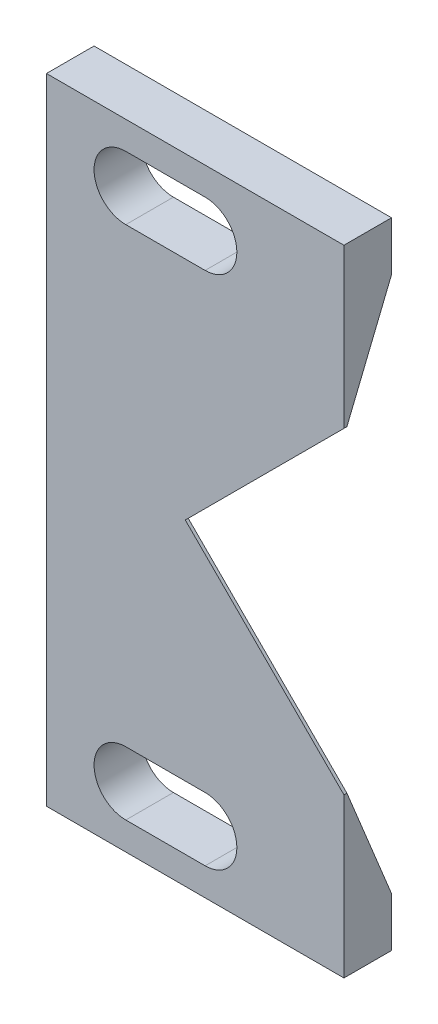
ISO-10303-21;
HEADER;
FILE_DESCRIPTION(('STEP AP214'),'2;1');
FILE_NAME('part.step','',(''),(''),'','','');
FILE_SCHEMA(('AUTOMOTIVE_DESIGN { 1 0 10303 214 1 1 1 1 }'));
ENDSEC;
DATA;
#1=APPLICATION_CONTEXT('core data for automotive mechanical design processes');
#2=APPLICATION_PROTOCOL_DEFINITION('international standard','automotive_design',2000,#1);
#3=PRODUCT_CONTEXT('',#1,'mechanical');
#4=PRODUCT('Part','Part','',(#3));
#5=PRODUCT_RELATED_PRODUCT_CATEGORY('part','',(#4));
#6=PRODUCT_DEFINITION_FORMATION('','',#4);
#7=PRODUCT_DEFINITION_CONTEXT('part definition',#1,'design');
#8=PRODUCT_DEFINITION('design','',#6,#7);
#9=PRODUCT_DEFINITION_SHAPE('','',#8);
#10=(LENGTH_UNIT() NAMED_UNIT(*) SI_UNIT(.MILLI.,.METRE.));
#11=(NAMED_UNIT(*) PLANE_ANGLE_UNIT() SI_UNIT($,.RADIAN.));
#12=(NAMED_UNIT(*) SI_UNIT($,.STERADIAN.) SOLID_ANGLE_UNIT());
#13=UNCERTAINTY_MEASURE_WITH_UNIT(LENGTH_MEASURE(1.E-05),#10,'distance_accuracy_value','');
#14=(GEOMETRIC_REPRESENTATION_CONTEXT(3) GLOBAL_UNCERTAINTY_ASSIGNED_CONTEXT((#13)) GLOBAL_UNIT_ASSIGNED_CONTEXT((#10,
#11,#12)) REPRESENTATION_CONTEXT('',''));
#15=CARTESIAN_POINT('',(0.,0.,0.));
#16=DIRECTION('',(0.,0.,1.));
#17=DIRECTION('',(1.,0.,0.));
#18=AXIS2_PLACEMENT_3D('',#15,#16,#17);
#19=CARTESIAN_POINT('',(0.,0.,2.4));
#20=DIRECTION('',(0.,0.,-1.));
#21=DIRECTION('',(-1.,0.,0.));
#22=AXIS2_PLACEMENT_3D('',#19,#20,#21);
#23=PLANE('',#22);
#24=CARTESIAN_POINT('',(4.,3.,2.4));
#25=DIRECTION('',(0.,0.,1.));
#26=DIRECTION('',(1.,0.,0.));
#27=AXIS2_PLACEMENT_3D('',#24,#25,#26);
#28=CIRCLE('',#27,1.6);
#29=CARTESIAN_POINT('',(4.,4.6,2.4));
#30=VERTEX_POINT('',#29);
#31=CARTESIAN_POINT('',(4.,1.4,2.4));
#32=VERTEX_POINT('',#31);
#33=EDGE_CURVE('E201',#30,#32,#28,.T.);
#34=ORIENTED_EDGE('',*,*,#33,.F.);
#35=DIRECTION('',(-1.,0.,0.));
#36=VECTOR('',#35,1.);
#37=CARTESIAN_POINT('',(4.,4.6,2.4));
#38=LINE('',#37,#36);
#39=CARTESIAN_POINT('',(8.,4.6,2.4));
#40=VERTEX_POINT('',#39);
#41=EDGE_CURVE('E208',#40,#30,#38,.T.);
#42=ORIENTED_EDGE('',*,*,#41,.F.);
#43=CARTESIAN_POINT('',(8.,3.,2.4));
#44=DIRECTION('',(0.,0.,1.));
#45=DIRECTION('',(1.,0.,0.));
#46=AXIS2_PLACEMENT_3D('',#43,#44,#45);
#47=CIRCLE('',#46,1.6);
#48=CARTESIAN_POINT('',(8.,1.4,2.4));
#49=VERTEX_POINT('',#48);
#50=EDGE_CURVE('E205',#49,#40,#47,.T.);
#51=ORIENTED_EDGE('',*,*,#50,.F.);
#52=DIRECTION('',(1.,0.,0.));
#53=VECTOR('',#52,1.);
#54=CARTESIAN_POINT('',(4.,1.4,2.4));
#55=LINE('',#54,#53);
#56=EDGE_CURVE('E203',#32,#49,#55,.T.);
#57=ORIENTED_EDGE('',*,*,#56,.F.);
#58=EDGE_LOOP('',(#34,#42,#51,#57));
#59=FACE_BOUND('',#58,.T.);
#60=DIRECTION('',(1.,0.,0.));
#61=VECTOR('',#60,1.);
#62=CARTESIAN_POINT('',(14.9999999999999,0.,2.4));
#63=LINE('',#62,#61);
#64=CARTESIAN_POINT('',(0.,0.,2.4));
#65=VERTEX_POINT('',#64);
#66=CARTESIAN_POINT('',(14.9999999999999,0.,2.4));
#67=VERTEX_POINT('',#66);
#68=EDGE_CURVE('E231',#65,#67,#63,.T.);
#69=ORIENTED_EDGE('',*,*,#68,.T.);
#70=DIRECTION('',(0.,1.,0.));
#71=VECTOR('',#70,1.);
#72=CARTESIAN_POINT('',(14.9999999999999,7.99999999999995,2.4));
#73=LINE('',#72,#71);
#74=CARTESIAN_POINT('',(14.9999999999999,7.99999999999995,2.4));
#75=VERTEX_POINT('',#74);
#76=EDGE_CURVE('E234',#67,#75,#73,.T.);
#77=ORIENTED_EDGE('',*,*,#76,.T.);
#78=DIRECTION('',(-0.707106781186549,0.707106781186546,0.));
#79=VECTOR('',#78,1.);
#80=CARTESIAN_POINT('',(6.99999999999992,15.9999999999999,2.4));
#81=LINE('',#80,#79);
#82=CARTESIAN_POINT('',(6.99999999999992,15.9999999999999,2.4));
#83=VERTEX_POINT('',#82);
#84=EDGE_CURVE('E236',#75,#83,#81,.T.);
#85=ORIENTED_EDGE('',*,*,#84,.T.);
#86=DIRECTION('',(0.707106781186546,0.707106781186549,0.));
#87=VECTOR('',#86,1.);
#88=CARTESIAN_POINT('',(14.9999999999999,23.9999999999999,2.4));
#89=LINE('',#88,#87);
#90=CARTESIAN_POINT('',(14.9999999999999,23.9999999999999,2.4));
#91=VERTEX_POINT('',#90);
#92=EDGE_CURVE('E238',#83,#91,#89,.T.);
#93=ORIENTED_EDGE('',*,*,#92,.T.);
#94=DIRECTION('',(0.,1.,0.));
#95=VECTOR('',#94,1.);
#96=CARTESIAN_POINT('',(14.9999999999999,31.9999999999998,2.4));
#97=LINE('',#96,#95);
#98=CARTESIAN_POINT('',(14.9999999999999,31.9999999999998,2.4));
#99=VERTEX_POINT('',#98);
#100=EDGE_CURVE('E240',#91,#99,#97,.T.);
#101=ORIENTED_EDGE('',*,*,#100,.T.);
#102=DIRECTION('',(-1.,0.,0.));
#103=VECTOR('',#102,1.);
#104=CARTESIAN_POINT('',(0.,31.9999999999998,2.4));
#105=LINE('',#104,#103);
#106=CARTESIAN_POINT('',(0.,31.9999999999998,2.4));
#107=VERTEX_POINT('',#106);
#108=EDGE_CURVE('E242',#99,#107,#105,.T.);
#109=ORIENTED_EDGE('',*,*,#108,.T.);
#110=DIRECTION('',(0.,-1.,0.));
#111=VECTOR('',#110,1.);
#112=CARTESIAN_POINT('',(0.,0.,2.4));
#113=LINE('',#112,#111);
#114=EDGE_CURVE('E244',#107,#65,#113,.T.);
#115=ORIENTED_EDGE('',*,*,#114,.T.);
#116=EDGE_LOOP('',(#69,#77,#85,#93,#101,#109,#115));
#117=FACE_BOUND('',#116,.T.);
#118=CARTESIAN_POINT('',(8.,28.9999999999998,2.4));
#119=DIRECTION('',(0.,0.,1.));
#120=DIRECTION('',(-1.,0.,0.));
#121=AXIS2_PLACEMENT_3D('',#118,#119,#120);
#122=CIRCLE('',#121,1.6);
#123=CARTESIAN_POINT('',(8.,27.3999999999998,2.4));
#124=VERTEX_POINT('',#123);
#125=CARTESIAN_POINT('',(8.,30.5999999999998,2.4));
#126=VERTEX_POINT('',#125);
#127=EDGE_CURVE('E163',#124,#126,#122,.T.);
#128=ORIENTED_EDGE('',*,*,#127,.F.);
#129=DIRECTION('',(1.,0.,0.));
#130=VECTOR('',#129,1.);
#131=CARTESIAN_POINT('',(4.,27.3999999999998,2.4));
#132=LINE('',#131,#130);
#133=CARTESIAN_POINT('',(4.,27.3999999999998,2.4));
#134=VERTEX_POINT('',#133);
#135=EDGE_CURVE('E183',#134,#124,#132,.T.);
#136=ORIENTED_EDGE('',*,*,#135,.F.);
#137=CARTESIAN_POINT('',(4.,28.9999999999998,2.4));
#138=DIRECTION('',(0.,0.,1.));
#139=DIRECTION('',(-1.,0.,0.));
#140=AXIS2_PLACEMENT_3D('',#137,#138,#139);
#141=CIRCLE('',#140,1.6);
#142=CARTESIAN_POINT('',(4.,30.5999999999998,2.4));
#143=VERTEX_POINT('',#142);
#144=EDGE_CURVE('E180',#143,#134,#141,.T.);
#145=ORIENTED_EDGE('',*,*,#144,.F.);
#146=DIRECTION('',(-1.,0.,0.));
#147=VECTOR('',#146,1.);
#148=CARTESIAN_POINT('',(4.,30.5999999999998,2.4));
#149=LINE('',#148,#147);
#150=EDGE_CURVE('E178',#126,#143,#149,.T.);
#151=ORIENTED_EDGE('',*,*,#150,.F.);
#152=EDGE_LOOP('',(#128,#136,#145,#151));
#153=FACE_BOUND('',#152,.T.);
#154=ADVANCED_FACE('F27',(#59,#117,#153),#23,.F.);
#155=CARTESIAN_POINT('',(0.,0.,0.));
#156=DIRECTION('',(0.,0.,-1.));
#157=DIRECTION('',(-1.,0.,0.));
#158=AXIS2_PLACEMENT_3D('',#155,#156,#157);
#159=PLANE('',#158);
#160=DIRECTION('',(-1.,0.,0.));
#161=VECTOR('',#160,1.);
#162=CARTESIAN_POINT('',(4.,4.6,0.));
#163=LINE('',#162,#161);
#164=CARTESIAN_POINT('',(8.,4.6,0.));
#165=VERTEX_POINT('',#164);
#166=CARTESIAN_POINT('',(4.,4.6,0.));
#167=VERTEX_POINT('',#166);
#168=EDGE_CURVE('E198',#165,#167,#163,.T.);
#169=ORIENTED_EDGE('',*,*,#168,.T.);
#170=CARTESIAN_POINT('',(4.,3.,0.));
#171=DIRECTION('',(0.,0.,1.));
#172=DIRECTION('',(1.,0.,0.));
#173=AXIS2_PLACEMENT_3D('',#170,#171,#172);
#174=CIRCLE('',#173,1.6);
#175=CARTESIAN_POINT('',(4.,1.4,0.));
#176=VERTEX_POINT('',#175);
#177=EDGE_CURVE('E164',#167,#176,#174,.T.);
#178=ORIENTED_EDGE('',*,*,#177,.T.);
#179=DIRECTION('',(1.,0.,0.));
#180=VECTOR('',#179,1.);
#181=CARTESIAN_POINT('',(4.,1.4,0.));
#182=LINE('',#181,#180);
#183=CARTESIAN_POINT('',(8.,1.4,0.));
#184=VERTEX_POINT('',#183);
#185=EDGE_CURVE('E192',#176,#184,#182,.T.);
#186=ORIENTED_EDGE('',*,*,#185,.T.);
#187=CARTESIAN_POINT('',(8.,3.,0.));
#188=DIRECTION('',(0.,0.,1.));
#189=DIRECTION('',(1.,0.,0.));
#190=AXIS2_PLACEMENT_3D('',#187,#188,#189);
#191=CIRCLE('',#190,1.6);
#192=EDGE_CURVE('E195',#184,#165,#191,.T.);
#193=ORIENTED_EDGE('',*,*,#192,.T.);
#194=EDGE_LOOP('',(#169,#178,#186,#193));
#195=FACE_BOUND('',#194,.T.);
#196=DIRECTION('',(0.,1.,0.));
#197=VECTOR('',#196,1.);
#198=CARTESIAN_POINT('',(14.9999999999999,31.9999999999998,0.));
#199=LINE('',#198,#197);
#200=CARTESIAN_POINT('',(14.9999999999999,29.5154328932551,0.));
#201=VERTEX_POINT('',#200);
#202=CARTESIAN_POINT('',(14.9999999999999,31.9999999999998,0.));
#203=VERTEX_POINT('',#202);
#204=EDGE_CURVE('E225',#201,#203,#199,.T.);
#205=ORIENTED_EDGE('',*,*,#204,.F.);
#206=DIRECTION('',(-0.707106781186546,-0.707106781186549,0.));
#207=VECTOR('',#206,1.);
#208=CARTESIAN_POINT('',(4.24228355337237,18.7577164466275,0.));
#209=LINE('',#208,#207);
#210=CARTESIAN_POINT('',(1.48456710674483,15.9999999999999,0.));
#211=VERTEX_POINT('',#210);
#212=EDGE_CURVE('E48',#201,#211,#209,.T.);
#213=ORIENTED_EDGE('',*,*,#212,.T.);
#214=DIRECTION('',(0.707106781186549,-0.707106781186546,0.));
#215=VECTOR('',#214,1.);
#216=CARTESIAN_POINT('',(12.2422835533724,5.2422835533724,0.));
#217=LINE('',#216,#215);
#218=CARTESIAN_POINT('',(14.9999999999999,2.48456710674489,0.));
#219=VERTEX_POINT('',#218);
#220=EDGE_CURVE('E271',#211,#219,#217,.T.);
#221=ORIENTED_EDGE('',*,*,#220,.T.);
#222=DIRECTION('',(0.,1.,0.));
#223=VECTOR('',#222,1.);
#224=CARTESIAN_POINT('',(14.9999999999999,7.99999999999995,0.));
#225=LINE('',#224,#223);
#226=CARTESIAN_POINT('',(14.9999999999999,0.,0.));
#227=VERTEX_POINT('',#226);
#228=EDGE_CURVE('E223',#227,#219,#225,.T.);
#229=ORIENTED_EDGE('',*,*,#228,.F.);
#230=DIRECTION('',(1.,0.,0.));
#231=VECTOR('',#230,1.);
#232=CARTESIAN_POINT('',(14.9999999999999,0.,0.));
#233=LINE('',#232,#231);
#234=CARTESIAN_POINT('',(0.,0.,0.));
#235=VERTEX_POINT('',#234);
#236=EDGE_CURVE('E220',#235,#227,#233,.T.);
#237=ORIENTED_EDGE('',*,*,#236,.F.);
#238=DIRECTION('',(0.,-1.,0.));
#239=VECTOR('',#238,1.);
#240=CARTESIAN_POINT('',(0.,0.,0.));
#241=LINE('',#240,#239);
#242=CARTESIAN_POINT('',(0.,31.9999999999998,0.));
#243=VERTEX_POINT('',#242);
#244=EDGE_CURVE('E229',#243,#235,#241,.T.);
#245=ORIENTED_EDGE('',*,*,#244,.F.);
#246=DIRECTION('',(-1.,0.,0.));
#247=VECTOR('',#246,1.);
#248=CARTESIAN_POINT('',(0.,31.9999999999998,0.));
#249=LINE('',#248,#247);
#250=EDGE_CURVE('E227',#203,#243,#249,.T.);
#251=ORIENTED_EDGE('',*,*,#250,.F.);
#252=EDGE_LOOP('',(#205,#213,#221,#229,#237,#245,#251));
#253=FACE_BOUND('',#252,.T.);
#254=DIRECTION('',(1.,0.,0.));
#255=VECTOR('',#254,1.);
#256=CARTESIAN_POINT('',(4.,27.3999999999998,0.));
#257=LINE('',#256,#255);
#258=CARTESIAN_POINT('',(4.,27.3999999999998,0.));
#259=VERTEX_POINT('',#258);
#260=CARTESIAN_POINT('',(8.,27.3999999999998,0.));
#261=VERTEX_POINT('',#260);
#262=EDGE_CURVE('E169',#259,#261,#257,.T.);
#263=ORIENTED_EDGE('',*,*,#262,.T.);
#264=CARTESIAN_POINT('',(8.,28.9999999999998,0.));
#265=DIRECTION('',(0.,0.,1.));
#266=DIRECTION('',(-1.,0.,0.));
#267=AXIS2_PLACEMENT_3D('',#264,#265,#266);
#268=CIRCLE('',#267,1.6);
#269=CARTESIAN_POINT('',(8.,30.5999999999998,0.));
#270=VERTEX_POINT('',#269);
#271=EDGE_CURVE('E156',#261,#270,#268,.T.);
#272=ORIENTED_EDGE('',*,*,#271,.T.);
#273=DIRECTION('',(-1.,0.,0.));
#274=VECTOR('',#273,1.);
#275=CARTESIAN_POINT('',(4.,30.5999999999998,0.));
#276=LINE('',#275,#274);
#277=CARTESIAN_POINT('',(4.,30.5999999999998,0.));
#278=VERTEX_POINT('',#277);
#279=EDGE_CURVE('E144',#270,#278,#276,.T.);
#280=ORIENTED_EDGE('',*,*,#279,.T.);
#281=CARTESIAN_POINT('',(4.,28.9999999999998,0.));
#282=DIRECTION('',(0.,0.,1.));
#283=DIRECTION('',(-1.,0.,0.));
#284=AXIS2_PLACEMENT_3D('',#281,#282,#283);
#285=CIRCLE('',#284,1.6);
#286=EDGE_CURVE('E155',#278,#259,#285,.T.);
#287=ORIENTED_EDGE('',*,*,#286,.T.);
#288=EDGE_LOOP('',(#263,#272,#280,#287));
#289=FACE_BOUND('',#288,.T.);
#290=ADVANCED_FACE('F167',(#195,#253,#289),#159,.T.);
#291=CARTESIAN_POINT('',(14.9999999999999,0.,2.4));
#292=DIRECTION('',(0.,1.,0.));
#293=DIRECTION('',(0.,0.,1.));
#294=AXIS2_PLACEMENT_3D('',#291,#292,#293);
#295=PLANE('',#294);
#296=ORIENTED_EDGE('',*,*,#236,.T.);
#297=DIRECTION('',(0.,0.,-1.));
#298=VECTOR('',#297,1.);
#299=CARTESIAN_POINT('',(14.9999999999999,0.,2.4));
#300=LINE('',#299,#298);
#301=EDGE_CURVE('E263',#67,#227,#300,.T.);
#302=ORIENTED_EDGE('',*,*,#301,.F.);
#303=ORIENTED_EDGE('',*,*,#68,.F.);
#304=DIRECTION('',(0.,0.,-1.));
#305=VECTOR('',#304,1.);
#306=CARTESIAN_POINT('',(0.,0.,2.4));
#307=LINE('',#306,#305);
#308=EDGE_CURVE('E246',#65,#235,#307,.T.);
#309=ORIENTED_EDGE('',*,*,#308,.T.);
#310=EDGE_LOOP('',(#296,#302,#303,#309));
#311=FACE_BOUND('',#310,.T.);
#312=ADVANCED_FACE('F29',(#311),#295,.F.);
#313=CARTESIAN_POINT('',(14.9999999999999,7.99999999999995,2.4));
#314=DIRECTION('',(-1.,0.,0.));
#315=DIRECTION('',(0.,-1.,0.));
#316=AXIS2_PLACEMENT_3D('',#313,#314,#315);
#317=PLANE('',#316);
#318=ORIENTED_EDGE('',*,*,#228,.T.);
#319=DIRECTION('',(0.,0.925820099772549,0.377964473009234));
#320=VECTOR('',#319,1.);
#321=CARTESIAN_POINT('',(14.9999999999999,14.8571428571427,5.05108289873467));
#322=LINE('',#321,#320);
#323=CARTESIAN_POINT('',(14.9999999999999,7.99999999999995,2.25166604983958));
#324=VERTEX_POINT('',#323);
#325=EDGE_CURVE('E11',#219,#324,#322,.T.);
#326=ORIENTED_EDGE('',*,*,#325,.T.);
#327=DIRECTION('',(0.,0.,-1.));
#328=VECTOR('',#327,1.);
#329=CARTESIAN_POINT('',(14.9999999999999,7.99999999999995,2.4));
#330=LINE('',#329,#328);
#331=EDGE_CURVE('E261',#75,#324,#330,.T.);
#332=ORIENTED_EDGE('',*,*,#331,.F.);
#333=ORIENTED_EDGE('',*,*,#76,.F.);
#334=ORIENTED_EDGE('',*,*,#301,.T.);
#335=EDGE_LOOP('',(#318,#326,#332,#333,#334));
#336=FACE_BOUND('',#335,.T.);
#337=ADVANCED_FACE('F307',(#336),#317,.F.);
#338=CARTESIAN_POINT('',(6.99999999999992,15.9999999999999,2.4));
#339=DIRECTION('',(-0.707106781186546,-0.707106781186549,0.));
#340=DIRECTION('',(0.707106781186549,-0.707106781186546,0.));
#341=AXIS2_PLACEMENT_3D('',#338,#339,#340);
#342=PLANE('',#341);
#343=ORIENTED_EDGE('',*,*,#331,.T.);
#344=DIRECTION('',(-0.707106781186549,0.707106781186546,0.));
#345=VECTOR('',#344,1.);
#346=CARTESIAN_POINT('',(6.99999999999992,15.9999999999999,2.25166604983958));
#347=LINE('',#346,#345);
#348=CARTESIAN_POINT('',(6.99999999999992,15.9999999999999,2.25166604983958));
#349=VERTEX_POINT('',#348);
#350=EDGE_CURVE('E35',#324,#349,#347,.T.);
#351=ORIENTED_EDGE('',*,*,#350,.T.);
#352=DIRECTION('',(0.,0.,-1.));
#353=VECTOR('',#352,1.);
#354=CARTESIAN_POINT('',(6.99999999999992,15.9999999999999,2.4));
#355=LINE('',#354,#353);
#356=EDGE_CURVE('E258',#83,#349,#355,.T.);
#357=ORIENTED_EDGE('',*,*,#356,.F.);
#358=ORIENTED_EDGE('',*,*,#84,.F.);
#359=EDGE_LOOP('',(#343,#351,#357,#358));
#360=FACE_BOUND('',#359,.T.);
#361=ADVANCED_FACE('F276',(#360),#342,.F.);
#362=CARTESIAN_POINT('',(14.9999999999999,23.9999999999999,2.4));
#363=DIRECTION('',(-0.707106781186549,0.707106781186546,0.));
#364=DIRECTION('',(-0.707106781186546,-0.707106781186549,0.));
#365=AXIS2_PLACEMENT_3D('',#362,#363,#364);
#366=PLANE('',#365);
#367=ORIENTED_EDGE('',*,*,#356,.T.);
#368=DIRECTION('',(0.707106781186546,0.707106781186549,0.));
#369=VECTOR('',#368,1.);
#370=CARTESIAN_POINT('',(14.9999999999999,23.9999999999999,2.25166604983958));
#371=LINE('',#370,#369);
#372=CARTESIAN_POINT('',(14.9999999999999,23.9999999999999,2.25166604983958));
#373=VERTEX_POINT('',#372);
#374=EDGE_CURVE('E266',#349,#373,#371,.T.);
#375=ORIENTED_EDGE('',*,*,#374,.T.);
#376=DIRECTION('',(0.,0.,-1.));
#377=VECTOR('',#376,1.);
#378=CARTESIAN_POINT('',(14.9999999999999,23.9999999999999,2.4));
#379=LINE('',#378,#377);
#380=EDGE_CURVE('E255',#91,#373,#379,.T.);
#381=ORIENTED_EDGE('',*,*,#380,.F.);
#382=ORIENTED_EDGE('',*,*,#92,.F.);
#383=EDGE_LOOP('',(#367,#375,#381,#382));
#384=FACE_BOUND('',#383,.T.);
#385=ADVANCED_FACE('F282',(#384),#366,.F.);
#386=CARTESIAN_POINT('',(14.9999999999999,31.9999999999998,2.4));
#387=DIRECTION('',(-1.,0.,0.));
#388=DIRECTION('',(0.,-1.,0.));
#389=AXIS2_PLACEMENT_3D('',#386,#387,#388);
#390=PLANE('',#389);
#391=ORIENTED_EDGE('',*,*,#380,.T.);
#392=DIRECTION('',(0.,0.92582009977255,-0.377964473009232));
#393=VECTOR('',#392,1.);
#394=CARTESIAN_POINT('',(14.9999999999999,23.9999999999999,2.25166604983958));
#395=LINE('',#394,#393);
#396=EDGE_CURVE('E269',#373,#201,#395,.T.);
#397=ORIENTED_EDGE('',*,*,#396,.T.);
#398=ORIENTED_EDGE('',*,*,#204,.T.);
#399=DIRECTION('',(0.,0.,-1.));
#400=VECTOR('',#399,1.);
#401=CARTESIAN_POINT('',(14.9999999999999,31.9999999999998,2.4));
#402=LINE('',#401,#400);
#403=EDGE_CURVE('E252',#99,#203,#402,.T.);
#404=ORIENTED_EDGE('',*,*,#403,.F.);
#405=ORIENTED_EDGE('',*,*,#100,.F.);
#406=EDGE_LOOP('',(#391,#397,#398,#404,#405));
#407=FACE_BOUND('',#406,.T.);
#408=ADVANCED_FACE('F289',(#407),#390,.F.);
#409=CARTESIAN_POINT('',(0.,31.9999999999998,2.4));
#410=DIRECTION('',(0.,-1.,0.));
#411=DIRECTION('',(0.,0.,-1.));
#412=AXIS2_PLACEMENT_3D('',#409,#410,#411);
#413=PLANE('',#412);
#414=ORIENTED_EDGE('',*,*,#250,.T.);
#415=DIRECTION('',(0.,0.,-1.));
#416=VECTOR('',#415,1.);
#417=CARTESIAN_POINT('',(0.,31.9999999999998,2.4));
#418=LINE('',#417,#416);
#419=EDGE_CURVE('E249',#107,#243,#418,.T.);
#420=ORIENTED_EDGE('',*,*,#419,.F.);
#421=ORIENTED_EDGE('',*,*,#108,.F.);
#422=ORIENTED_EDGE('',*,*,#403,.T.);
#423=EDGE_LOOP('',(#414,#420,#421,#422));
#424=FACE_BOUND('',#423,.T.);
#425=ADVANCED_FACE('F297',(#424),#413,.F.);
#426=CARTESIAN_POINT('',(0.,0.,2.4));
#427=DIRECTION('',(1.,0.,0.));
#428=DIRECTION('',(0.,0.,-1.));
#429=AXIS2_PLACEMENT_3D('',#426,#427,#428);
#430=PLANE('',#429);
#431=ORIENTED_EDGE('',*,*,#244,.T.);
#432=ORIENTED_EDGE('',*,*,#308,.F.);
#433=ORIENTED_EDGE('',*,*,#114,.F.);
#434=ORIENTED_EDGE('',*,*,#419,.T.);
#435=EDGE_LOOP('',(#431,#432,#433,#434));
#436=FACE_BOUND('',#435,.T.);
#437=ADVANCED_FACE('F301',(#436),#430,.F.);
#438=CARTESIAN_POINT('',(4.,3.,2.4));
#439=DIRECTION('',(0.,0.,-1.));
#440=DIRECTION('',(-1.,0.,0.));
#441=AXIS2_PLACEMENT_3D('',#438,#439,#440);
#442=CYLINDRICAL_SURFACE('',#441,1.6);
#443=ORIENTED_EDGE('',*,*,#177,.F.);
#444=DIRECTION('',(0.,0.,-1.));
#445=VECTOR('',#444,1.);
#446=CARTESIAN_POINT('',(4.,4.6,2.4));
#447=LINE('',#446,#445);
#448=EDGE_CURVE('E210',#30,#167,#447,.T.);
#449=ORIENTED_EDGE('',*,*,#448,.F.);
#450=ORIENTED_EDGE('',*,*,#33,.T.);
#451=DIRECTION('',(0.,0.,-1.));
#452=VECTOR('',#451,1.);
#453=CARTESIAN_POINT('',(4.,1.4,2.4));
#454=LINE('',#453,#452);
#455=EDGE_CURVE('E217',#32,#176,#454,.T.);
#456=ORIENTED_EDGE('',*,*,#455,.T.);
#457=EDGE_LOOP('',(#443,#449,#450,#456));
#458=FACE_BOUND('',#457,.T.);
#459=ADVANCED_FACE('F328',(#458),#442,.F.);
#460=CARTESIAN_POINT('',(4.,1.4,2.4));
#461=DIRECTION('',(0.,1.,0.));
#462=DIRECTION('',(-1.,0.,0.));
#463=AXIS2_PLACEMENT_3D('',#460,#461,#462);
#464=PLANE('',#463);
#465=ORIENTED_EDGE('',*,*,#185,.F.);
#466=ORIENTED_EDGE('',*,*,#455,.F.);
#467=ORIENTED_EDGE('',*,*,#56,.T.);
#468=DIRECTION('',(0.,0.,-1.));
#469=VECTOR('',#468,1.);
#470=CARTESIAN_POINT('',(8.,1.4,2.4));
#471=LINE('',#470,#469);
#472=EDGE_CURVE('E215',#49,#184,#471,.T.);
#473=ORIENTED_EDGE('',*,*,#472,.T.);
#474=EDGE_LOOP('',(#465,#466,#467,#473));
#475=FACE_BOUND('',#474,.T.);
#476=ADVANCED_FACE('F356',(#475),#464,.T.);
#477=CARTESIAN_POINT('',(8.,3.,2.4));
#478=DIRECTION('',(0.,0.,-1.));
#479=DIRECTION('',(-1.,0.,0.));
#480=AXIS2_PLACEMENT_3D('',#477,#478,#479);
#481=CYLINDRICAL_SURFACE('',#480,1.6);
#482=ORIENTED_EDGE('',*,*,#192,.F.);
#483=ORIENTED_EDGE('',*,*,#472,.F.);
#484=ORIENTED_EDGE('',*,*,#50,.T.);
#485=DIRECTION('',(0.,0.,-1.));
#486=VECTOR('',#485,1.);
#487=CARTESIAN_POINT('',(8.,4.6,2.4));
#488=LINE('',#487,#486);
#489=EDGE_CURVE('E213',#40,#165,#488,.T.);
#490=ORIENTED_EDGE('',*,*,#489,.T.);
#491=EDGE_LOOP('',(#482,#483,#484,#490));
#492=FACE_BOUND('',#491,.T.);
#493=ADVANCED_FACE('F363',(#492),#481,.F.);
#494=CARTESIAN_POINT('',(4.,4.6,2.4));
#495=DIRECTION('',(0.,-1.,0.));
#496=DIRECTION('',(0.,0.,-1.));
#497=AXIS2_PLACEMENT_3D('',#494,#495,#496);
#498=PLANE('',#497);
#499=ORIENTED_EDGE('',*,*,#168,.F.);
#500=ORIENTED_EDGE('',*,*,#489,.F.);
#501=ORIENTED_EDGE('',*,*,#41,.T.);
#502=ORIENTED_EDGE('',*,*,#448,.T.);
#503=EDGE_LOOP('',(#499,#500,#501,#502));
#504=FACE_BOUND('',#503,.T.);
#505=ADVANCED_FACE('F371',(#504),#498,.T.);
#506=CARTESIAN_POINT('',(8.,28.9999999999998,2.4));
#507=DIRECTION('',(0.,0.,-1.));
#508=DIRECTION('',(-1.,0.,0.));
#509=AXIS2_PLACEMENT_3D('',#506,#507,#508);
#510=CYLINDRICAL_SURFACE('',#509,1.6);
#511=ORIENTED_EDGE('',*,*,#271,.F.);
#512=DIRECTION('',(0.,0.,-1.));
#513=VECTOR('',#512,1.);
#514=CARTESIAN_POINT('',(8.,27.3999999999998,2.4));
#515=LINE('',#514,#513);
#516=EDGE_CURVE('E185',#124,#261,#515,.T.);
#517=ORIENTED_EDGE('',*,*,#516,.F.);
#518=ORIENTED_EDGE('',*,*,#127,.T.);
#519=DIRECTION('',(0.,0.,-1.));
#520=VECTOR('',#519,1.);
#521=CARTESIAN_POINT('',(8.,30.5999999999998,2.4));
#522=LINE('',#521,#520);
#523=EDGE_CURVE('E147',#126,#270,#522,.T.);
#524=ORIENTED_EDGE('',*,*,#523,.T.);
#525=EDGE_LOOP('',(#511,#517,#518,#524));
#526=FACE_BOUND('',#525,.T.);
#527=ADVANCED_FACE('F159',(#526),#510,.F.);
#528=CARTESIAN_POINT('',(4.,30.5999999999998,2.4));
#529=DIRECTION('',(0.,-1.,0.));
#530=DIRECTION('',(1.,0.,0.));
#531=AXIS2_PLACEMENT_3D('',#528,#529,#530);
#532=PLANE('',#531);
#533=ORIENTED_EDGE('',*,*,#279,.F.);
#534=ORIENTED_EDGE('',*,*,#523,.F.);
#535=ORIENTED_EDGE('',*,*,#150,.T.);
#536=DIRECTION('',(0.,0.,-1.));
#537=VECTOR('',#536,1.);
#538=CARTESIAN_POINT('',(4.,30.5999999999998,2.4));
#539=LINE('',#538,#537);
#540=EDGE_CURVE('E150',#143,#278,#539,.T.);
#541=ORIENTED_EDGE('',*,*,#540,.T.);
#542=EDGE_LOOP('',(#533,#534,#535,#541));
#543=FACE_BOUND('',#542,.T.);
#544=ADVANCED_FACE('F146',(#543),#532,.T.);
#545=CARTESIAN_POINT('',(4.,28.9999999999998,2.4));
#546=DIRECTION('',(0.,0.,-1.));
#547=DIRECTION('',(-1.,0.,0.));
#548=AXIS2_PLACEMENT_3D('',#545,#546,#547);
#549=CYLINDRICAL_SURFACE('',#548,1.6);
#550=ORIENTED_EDGE('',*,*,#286,.F.);
#551=ORIENTED_EDGE('',*,*,#540,.F.);
#552=ORIENTED_EDGE('',*,*,#144,.T.);
#553=DIRECTION('',(0.,0.,-1.));
#554=VECTOR('',#553,1.);
#555=CARTESIAN_POINT('',(4.,27.3999999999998,2.4));
#556=LINE('',#555,#554);
#557=EDGE_CURVE('E187',#134,#259,#556,.T.);
#558=ORIENTED_EDGE('',*,*,#557,.T.);
#559=EDGE_LOOP('',(#550,#551,#552,#558));
#560=FACE_BOUND('',#559,.T.);
#561=ADVANCED_FACE('F392',(#560),#549,.F.);
#562=CARTESIAN_POINT('',(4.,27.3999999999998,2.4));
#563=DIRECTION('',(0.,1.,0.));
#564=DIRECTION('',(0.,0.,1.));
#565=AXIS2_PLACEMENT_3D('',#562,#563,#564);
#566=PLANE('',#565);
#567=ORIENTED_EDGE('',*,*,#262,.F.);
#568=ORIENTED_EDGE('',*,*,#557,.F.);
#569=ORIENTED_EDGE('',*,*,#135,.T.);
#570=ORIENTED_EDGE('',*,*,#516,.T.);
#571=EDGE_LOOP('',(#567,#568,#569,#570));
#572=FACE_BOUND('',#571,.T.);
#573=ADVANCED_FACE('F399',(#572),#566,.T.);
#574=CARTESIAN_POINT('',(6.99999999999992,15.9999999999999,2.25166604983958));
#575=DIRECTION('',(0.353553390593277,0.353553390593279,-0.866025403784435));
#576=DIRECTION('',(0.,0.925820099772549,0.377964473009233));
#577=AXIS2_PLACEMENT_3D('',#574,#575,#576);
#578=PLANE('',#577);
#579=ORIENTED_EDGE('',*,*,#325,.F.);
#580=ORIENTED_EDGE('',*,*,#220,.F.);
#581=DIRECTION('',(0.925820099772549,0.,0.377964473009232));
#582=VECTOR('',#581,1.);
#583=CARTESIAN_POINT('',(13.8571428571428,15.9999999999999,5.05108289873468));
#584=LINE('',#583,#582);
#585=EDGE_CURVE('E170',#349,#211,#584,.F.);
#586=ORIENTED_EDGE('',*,*,#585,.F.);
#587=ORIENTED_EDGE('',*,*,#350,.F.);
#588=EDGE_LOOP('',(#579,#580,#586,#587));
#589=FACE_BOUND('',#588,.T.);
#590=ADVANCED_FACE('F285',(#589),#578,.T.);
#591=CARTESIAN_POINT('',(14.9999999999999,23.9999999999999,2.25166604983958));
#592=DIRECTION('',(0.353553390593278,-0.353553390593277,-0.866025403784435));
#593=DIRECTION('',(-0.925820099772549,0.,-0.377964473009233));
#594=AXIS2_PLACEMENT_3D('',#591,#592,#593);
#595=PLANE('',#594);
#596=ORIENTED_EDGE('',*,*,#585,.T.);
#597=ORIENTED_EDGE('',*,*,#212,.F.);
#598=ORIENTED_EDGE('',*,*,#396,.F.);
#599=ORIENTED_EDGE('',*,*,#374,.F.);
#600=EDGE_LOOP('',(#596,#597,#598,#599));
#601=FACE_BOUND('',#600,.T.);
#602=ADVANCED_FACE('F287',(#601),#595,.T.);
#603=CLOSED_SHELL('',(#154,#290,#312,#337,#361,#385,#408,#425,#437,#459,#476,#493,#505,#527,
#544,#561,#573,#590,#602));
#604=MANIFOLD_SOLID_BREP('B2',#603);
#605=ADVANCED_BREP_SHAPE_REPRESENTATION('',(#18,#604),#14);
#606=SHAPE_DEFINITION_REPRESENTATION(#9,#605);
ENDSEC;
END-ISO-10303-21;
